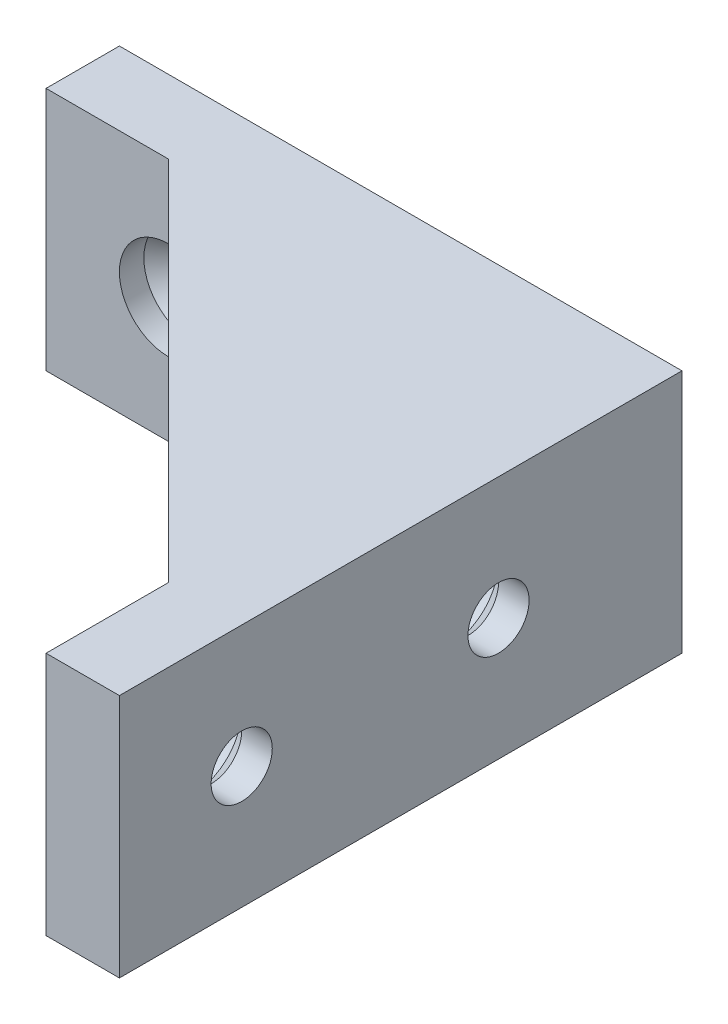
ISO-10303-21;
HEADER;
FILE_DESCRIPTION(('STEP AP214'),'2;1');
FILE_NAME('part.step','',(''),(''),'','','');
FILE_SCHEMA(('AUTOMOTIVE_DESIGN { 1 0 10303 214 1 1 1 1 }'));
ENDSEC;
DATA;
#1=APPLICATION_CONTEXT('core data for automotive mechanical design processes');
#2=APPLICATION_PROTOCOL_DEFINITION('international standard','automotive_design',2000,#1);
#3=PRODUCT_CONTEXT('',#1,'mechanical');
#4=PRODUCT('Part','Part','',(#3));
#5=PRODUCT_RELATED_PRODUCT_CATEGORY('part','',(#4));
#6=PRODUCT_DEFINITION_FORMATION('','',#4);
#7=PRODUCT_DEFINITION_CONTEXT('part definition',#1,'design');
#8=PRODUCT_DEFINITION('design','',#6,#7);
#9=PRODUCT_DEFINITION_SHAPE('','',#8);
#10=(LENGTH_UNIT() NAMED_UNIT(*) SI_UNIT(.MILLI.,.METRE.));
#11=(NAMED_UNIT(*) PLANE_ANGLE_UNIT() SI_UNIT($,.RADIAN.));
#12=(NAMED_UNIT(*) SI_UNIT($,.STERADIAN.) SOLID_ANGLE_UNIT());
#13=UNCERTAINTY_MEASURE_WITH_UNIT(LENGTH_MEASURE(1.E-05),#10,'distance_accuracy_value','');
#14=(GEOMETRIC_REPRESENTATION_CONTEXT(3) GLOBAL_UNCERTAINTY_ASSIGNED_CONTEXT((#13)) GLOBAL_UNIT_ASSIGNED_CONTEXT((#10,
#11,#12)) REPRESENTATION_CONTEXT('',''));
#15=CARTESIAN_POINT('',(0.,0.,0.));
#16=DIRECTION('',(0.,0.,1.));
#17=DIRECTION('',(1.,0.,0.));
#18=AXIS2_PLACEMENT_3D('',#15,#16,#17);
#19=CARTESIAN_POINT('',(31.,10.,40.));
#20=DIRECTION('',(0.,0.,-1.));
#21=DIRECTION('',(-1.,0.,0.));
#22=AXIS2_PLACEMENT_3D('',#19,#20,#21);
#23=CYLINDRICAL_SURFACE('',#22,4.);
#24=CARTESIAN_POINT('',(31.,10.,-2.));
#25=DIRECTION('',(0.,0.,-1.));
#26=DIRECTION('',(-1.,0.,0.));
#27=AXIS2_PLACEMENT_3D('',#24,#25,#26);
#28=CIRCLE('',#27,4.);
#29=CARTESIAN_POINT('',(27.,10.,-2.));
#30=VERTEX_POINT('',#29);
#31=EDGE_CURVE('E473',#30,#30,#28,.T.);
#32=ORIENTED_EDGE('',*,*,#31,.T.);
#33=EDGE_LOOP('',(#32));
#34=FACE_BOUND('',#33,.T.);
#35=CARTESIAN_POINT('',(31.,10.,8.99999999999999));
#36=DIRECTION('',(-0.707106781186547,0.,-0.707106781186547));
#37=DIRECTION('',(0.707106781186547,0.,-0.707106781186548));
#38=AXIS2_PLACEMENT_3D('',#35,#36,#37);
#39=ELLIPSE('',#38,5.65685424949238,4.);
#40=CARTESIAN_POINT('',(31.,6.,8.99999999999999));
#41=VERTEX_POINT('',#40);
#42=CARTESIAN_POINT('',(31.,14.,8.99999999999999));
#43=VERTEX_POINT('',#42);
#44=EDGE_CURVE('E50',#41,#43,#39,.F.);
#45=ORIENTED_EDGE('',*,*,#44,.T.);
#46=CARTESIAN_POINT('',(31.,10.,8.99999999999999));
#47=DIRECTION('',(0.707106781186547,0.,-0.707106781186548));
#48=DIRECTION('',(-0.707106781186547,0.,-0.707106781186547));
#49=AXIS2_PLACEMENT_3D('',#46,#47,#48);
#50=ELLIPSE('',#49,5.65685424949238,4.);
#51=EDGE_CURVE('E117',#43,#41,#50,.F.);
#52=ORIENTED_EDGE('',*,*,#51,.T.);
#53=EDGE_LOOP('',(#45,#52));
#54=FACE_BOUND('',#53,.T.);
#55=ADVANCED_FACE('F35',(#34,#54),#23,.F.);
#56=CARTESIAN_POINT('',(0.,10.,8.99999999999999));
#57=DIRECTION('',(1.,0.,0.));
#58=DIRECTION('',(0.,0.,-1.));
#59=AXIS2_PLACEMENT_3D('',#56,#57,#58);
#60=CYLINDRICAL_SURFACE('',#59,2.5);
#61=CARTESIAN_POINT('',(43.5,10.,8.99999999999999));
#62=DIRECTION('',(1.,0.,0.));
#63=DIRECTION('',(0.,0.,-1.));
#64=AXIS2_PLACEMENT_3D('',#61,#62,#63);
#65=CIRCLE('',#64,2.5);
#66=CARTESIAN_POINT('',(43.5,10.,6.49999999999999));
#67=VERTEX_POINT('',#66);
#68=EDGE_CURVE('E44',#67,#67,#65,.F.);
#69=ORIENTED_EDGE('',*,*,#68,.T.);
#70=EDGE_LOOP('',(#69));
#71=FACE_BOUND('',#70,.T.);
#72=CARTESIAN_POINT('',(46.,10.,8.99999999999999));
#73=DIRECTION('',(1.,0.,0.));
#74=DIRECTION('',(0.,0.,-1.));
#75=AXIS2_PLACEMENT_3D('',#72,#73,#74);
#76=CIRCLE('',#75,2.5);
#77=CARTESIAN_POINT('',(46.,10.,6.49999999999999));
#78=VERTEX_POINT('',#77);
#79=EDGE_CURVE('E394',#78,#78,#76,.T.);
#80=ORIENTED_EDGE('',*,*,#79,.T.);
#81=EDGE_LOOP('',(#80));
#82=FACE_BOUND('',#81,.T.);
#83=ADVANCED_FACE('F141',(#71,#82),#60,.F.);
#84=CARTESIAN_POINT('',(0.,20.,-6.));
#85=DIRECTION('',(1.,0.,0.));
#86=DIRECTION('',(0.,0.,-1.));
#87=AXIS2_PLACEMENT_3D('',#84,#85,#86);
#88=PLANE('',#87);
#89=DIRECTION('',(0.,0.,1.));
#90=VECTOR('',#89,1.);
#91=CARTESIAN_POINT('',(0.,0.,-6.));
#92=LINE('',#91,#90);
#93=CARTESIAN_POINT('',(0.,0.,-6.));
#94=VERTEX_POINT('',#93);
#95=CARTESIAN_POINT('',(0.,0.,0.));
#96=VERTEX_POINT('',#95);
#97=EDGE_CURVE('E380',#94,#96,#92,.T.);
#98=ORIENTED_EDGE('',*,*,#97,.T.);
#99=DIRECTION('',(0.,-1.,0.));
#100=VECTOR('',#99,1.);
#101=CARTESIAN_POINT('',(0.,20.,0.));
#102=LINE('',#101,#100);
#103=CARTESIAN_POINT('',(0.,20.,0.));
#104=VERTEX_POINT('',#103);
#105=EDGE_CURVE('E383',#104,#96,#102,.T.);
#106=ORIENTED_EDGE('',*,*,#105,.F.);
#107=DIRECTION('',(0.,0.,1.));
#108=VECTOR('',#107,1.);
#109=CARTESIAN_POINT('',(0.,20.,-6.));
#110=LINE('',#109,#108);
#111=CARTESIAN_POINT('',(0.,20.,-6.));
#112=VERTEX_POINT('',#111);
#113=EDGE_CURVE('E410',#112,#104,#110,.T.);
#114=ORIENTED_EDGE('',*,*,#113,.F.);
#115=DIRECTION('',(0.,-1.,0.));
#116=VECTOR('',#115,1.);
#117=CARTESIAN_POINT('',(0.,20.,-6.));
#118=LINE('',#117,#116);
#119=EDGE_CURVE('E385',#112,#94,#118,.T.);
#120=ORIENTED_EDGE('',*,*,#119,.T.);
#121=EDGE_LOOP('',(#98,#106,#114,#120));
#122=FACE_BOUND('',#121,.T.);
#123=ADVANCED_FACE('F164',(#122),#88,.F.);
#124=CARTESIAN_POINT('',(0.,20.,0.));
#125=DIRECTION('',(0.,0.,-1.));
#126=DIRECTION('',(-1.,0.,0.));
#127=AXIS2_PLACEMENT_3D('',#124,#125,#126);
#128=PLANE('',#127);
#129=DIRECTION('',(0.,-1.,0.));
#130=VECTOR('',#129,1.);
#131=CARTESIAN_POINT('',(10.,20.,0.));
#132=LINE('',#131,#130);
#133=CARTESIAN_POINT('',(10.,6.,0.));
#134=VERTEX_POINT('',#133);
#135=CARTESIAN_POINT('',(10.,0.,0.));
#136=VERTEX_POINT('',#135);
#137=EDGE_CURVE('E425',#134,#136,#132,.T.);
#138=ORIENTED_EDGE('',*,*,#137,.F.);
#139=CARTESIAN_POINT('',(10.,10.,0.));
#140=DIRECTION('',(0.,0.,-1.));
#141=DIRECTION('',(-1.,0.,0.));
#142=AXIS2_PLACEMENT_3D('',#139,#140,#141);
#143=CIRCLE('',#142,4.);
#144=CARTESIAN_POINT('',(10.,14.,0.));
#145=VERTEX_POINT('',#144);
#146=EDGE_CURVE('E437',#134,#145,#143,.T.);
#147=ORIENTED_EDGE('',*,*,#146,.T.);
#148=CARTESIAN_POINT('',(10.,20.,0.));
#149=VERTEX_POINT('',#148);
#150=EDGE_CURVE('E426',#149,#145,#132,.T.);
#151=ORIENTED_EDGE('',*,*,#150,.F.);
#152=DIRECTION('',(1.,0.,0.));
#153=VECTOR('',#152,1.);
#154=CARTESIAN_POINT('',(0.,20.,0.));
#155=LINE('',#154,#153);
#156=EDGE_CURVE('E446',#104,#149,#155,.T.);
#157=ORIENTED_EDGE('',*,*,#156,.F.);
#158=ORIENTED_EDGE('',*,*,#105,.T.);
#159=DIRECTION('',(1.,0.,0.));
#160=VECTOR('',#159,1.);
#161=CARTESIAN_POINT('',(0.,0.,0.));
#162=LINE('',#161,#160);
#163=EDGE_CURVE('E387',#96,#136,#162,.T.);
#164=ORIENTED_EDGE('',*,*,#163,.T.);
#165=EDGE_LOOP('',(#138,#147,#151,#157,#158,#164));
#166=FACE_BOUND('',#165,.T.);
#167=ADVANCED_FACE('F336',(#166),#128,.F.);
#168=CARTESIAN_POINT('',(40.,20.,30.));
#169=DIRECTION('',(0.707106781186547,0.,-0.707106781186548));
#170=DIRECTION('',(-0.707106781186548,0.,-0.707106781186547));
#171=AXIS2_PLACEMENT_3D('',#168,#169,#170);
#172=PLANE('',#171);
#173=CARTESIAN_POINT('',(19.,10.,8.99999999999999));
#174=DIRECTION('',(0.707106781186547,0.,-0.707106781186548));
#175=DIRECTION('',(0.707106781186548,0.,0.707106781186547));
#176=AXIS2_PLACEMENT_3D('',#173,#174,#175);
#177=ELLIPSE('',#176,5.65685424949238,4.);
#178=CARTESIAN_POINT('',(23.,10.,13.));
#179=VERTEX_POINT('',#178);
#180=EDGE_CURVE('E477',#179,#179,#177,.T.);
#181=ORIENTED_EDGE('',*,*,#180,.T.);
#182=EDGE_LOOP('',(#181));
#183=FACE_BOUND('',#182,.T.);
#184=CARTESIAN_POINT('',(31.,10.,21.));
#185=DIRECTION('',(0.707106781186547,0.,-0.707106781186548));
#186=DIRECTION('',(-0.707106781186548,0.,-0.707106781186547));
#187=AXIS2_PLACEMENT_3D('',#184,#185,#186);
#188=ELLIPSE('',#187,5.65685424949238,4.);
#189=CARTESIAN_POINT('',(27.,10.,17.));
#190=VERTEX_POINT('',#189);
#191=EDGE_CURVE('E469',#190,#190,#188,.T.);
#192=ORIENTED_EDGE('',*,*,#191,.T.);
#193=EDGE_LOOP('',(#192));
#194=FACE_BOUND('',#193,.T.);
#195=DIRECTION('',(0.,-1.,0.));
#196=VECTOR('',#195,1.);
#197=CARTESIAN_POINT('',(40.,20.,30.));
#198=LINE('',#197,#196);
#199=CARTESIAN_POINT('',(40.,6.,30.));
#200=VERTEX_POINT('',#199);
#201=CARTESIAN_POINT('',(40.,0.,30.));
#202=VERTEX_POINT('',#201);
#203=EDGE_CURVE('E421',#200,#202,#198,.T.);
#204=ORIENTED_EDGE('',*,*,#203,.F.);
#205=CARTESIAN_POINT('',(40.,10.,30.));
#206=DIRECTION('',(0.707106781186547,0.,-0.707106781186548));
#207=DIRECTION('',(0.707106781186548,0.,0.707106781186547));
#208=AXIS2_PLACEMENT_3D('',#205,#206,#207);
#209=ELLIPSE('',#208,5.65685424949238,4.);
#210=CARTESIAN_POINT('',(40.,14.,30.));
#211=VERTEX_POINT('',#210);
#212=EDGE_CURVE('E57',#200,#211,#209,.T.);
#213=ORIENTED_EDGE('',*,*,#212,.T.);
#214=CARTESIAN_POINT('',(40.,20.,30.));
#215=VERTEX_POINT('',#214);
#216=EDGE_CURVE('E422',#215,#211,#198,.T.);
#217=ORIENTED_EDGE('',*,*,#216,.F.);
#218=DIRECTION('',(0.707106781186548,0.,0.707106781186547));
#219=VECTOR('',#218,1.);
#220=CARTESIAN_POINT('',(40.,20.,30.));
#221=LINE('',#220,#219);
#222=EDGE_CURVE('E445',#149,#215,#221,.T.);
#223=ORIENTED_EDGE('',*,*,#222,.F.);
#224=ORIENTED_EDGE('',*,*,#150,.T.);
#225=CARTESIAN_POINT('',(10.,10.,0.));
#226=DIRECTION('',(0.707106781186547,0.,-0.707106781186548));
#227=DIRECTION('',(-0.707106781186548,0.,-0.707106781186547));
#228=AXIS2_PLACEMENT_3D('',#225,#226,#227);
#229=ELLIPSE('',#228,5.65685424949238,4.);
#230=EDGE_CURVE('E124',#145,#134,#229,.T.);
#231=ORIENTED_EDGE('',*,*,#230,.T.);
#232=ORIENTED_EDGE('',*,*,#137,.T.);
#233=DIRECTION('',(0.707106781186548,0.,0.707106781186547));
#234=VECTOR('',#233,1.);
#235=CARTESIAN_POINT('',(40.,0.,30.));
#236=LINE('',#235,#234);
#237=EDGE_CURVE('E391',#136,#202,#236,.T.);
#238=ORIENTED_EDGE('',*,*,#237,.T.);
#239=EDGE_LOOP('',(#204,#213,#217,#223,#224,#231,#232,#238));
#240=FACE_BOUND('',#239,.T.);
#241=ADVANCED_FACE('F328',(#183,#194,#240),#172,.F.);
#242=CARTESIAN_POINT('',(40.,20.,30.));
#243=DIRECTION('',(1.,0.,0.));
#244=DIRECTION('',(0.,0.,-1.));
#245=AXIS2_PLACEMENT_3D('',#242,#243,#244);
#246=PLANE('',#245);
#247=ORIENTED_EDGE('',*,*,#216,.T.);
#248=CARTESIAN_POINT('',(40.,10.,30.));
#249=DIRECTION('',(1.,0.,0.));
#250=DIRECTION('',(0.,0.,-1.));
#251=AXIS2_PLACEMENT_3D('',#248,#249,#250);
#252=CIRCLE('',#251,4.);
#253=EDGE_CURVE('E126',#211,#200,#252,.T.);
#254=ORIENTED_EDGE('',*,*,#253,.T.);
#255=ORIENTED_EDGE('',*,*,#203,.T.);
#256=DIRECTION('',(0.,0.,1.));
#257=VECTOR('',#256,1.);
#258=CARTESIAN_POINT('',(40.,0.,30.));
#259=LINE('',#258,#257);
#260=CARTESIAN_POINT('',(40.,0.,40.));
#261=VERTEX_POINT('',#260);
#262=EDGE_CURVE('E402',#202,#261,#259,.T.);
#263=ORIENTED_EDGE('',*,*,#262,.T.);
#264=DIRECTION('',(0.,-1.,0.));
#265=VECTOR('',#264,1.);
#266=CARTESIAN_POINT('',(40.,20.,40.));
#267=LINE('',#266,#265);
#268=CARTESIAN_POINT('',(40.,20.,40.));
#269=VERTEX_POINT('',#268);
#270=EDGE_CURVE('E418',#269,#261,#267,.T.);
#271=ORIENTED_EDGE('',*,*,#270,.F.);
#272=DIRECTION('',(0.,0.,1.));
#273=VECTOR('',#272,1.);
#274=CARTESIAN_POINT('',(40.,20.,30.));
#275=LINE('',#274,#273);
#276=EDGE_CURVE('E444',#215,#269,#275,.T.);
#277=ORIENTED_EDGE('',*,*,#276,.F.);
#278=EDGE_LOOP('',(#247,#254,#255,#263,#271,#277));
#279=FACE_BOUND('',#278,.T.);
#280=ADVANCED_FACE('F319',(#279),#246,.F.);
#281=CARTESIAN_POINT('',(40.,20.,40.));
#282=DIRECTION('',(0.,0.,-1.));
#283=DIRECTION('',(-1.,0.,0.));
#284=AXIS2_PLACEMENT_3D('',#281,#282,#283);
#285=PLANE('',#284);
#286=DIRECTION('',(1.,0.,0.));
#287=VECTOR('',#286,1.);
#288=CARTESIAN_POINT('',(40.,0.,40.));
#289=LINE('',#288,#287);
#290=CARTESIAN_POINT('',(46.,0.,40.));
#291=VERTEX_POINT('',#290);
#292=EDGE_CURVE('E404',#261,#291,#289,.T.);
#293=ORIENTED_EDGE('',*,*,#292,.T.);
#294=DIRECTION('',(0.,-1.,0.));
#295=VECTOR('',#294,1.);
#296=CARTESIAN_POINT('',(46.,20.,40.));
#297=LINE('',#296,#295);
#298=CARTESIAN_POINT('',(46.,20.,40.));
#299=VERTEX_POINT('',#298);
#300=EDGE_CURVE('E415',#299,#291,#297,.T.);
#301=ORIENTED_EDGE('',*,*,#300,.F.);
#302=DIRECTION('',(1.,0.,0.));
#303=VECTOR('',#302,1.);
#304=CARTESIAN_POINT('',(40.,20.,40.));
#305=LINE('',#304,#303);
#306=EDGE_CURVE('E448',#269,#299,#305,.T.);
#307=ORIENTED_EDGE('',*,*,#306,.F.);
#308=ORIENTED_EDGE('',*,*,#270,.T.);
#309=EDGE_LOOP('',(#293,#301,#307,#308));
#310=FACE_BOUND('',#309,.T.);
#311=ADVANCED_FACE('F311',(#310),#285,.F.);
#312=CARTESIAN_POINT('',(46.,20.,-6.));
#313=DIRECTION('',(-1.,0.,0.));
#314=DIRECTION('',(0.,0.,1.));
#315=AXIS2_PLACEMENT_3D('',#312,#313,#314);
#316=PLANE('',#315);
#317=CARTESIAN_POINT('',(46.,10.,30.));
#318=DIRECTION('',(1.,0.,0.));
#319=DIRECTION('',(0.,0.,-1.));
#320=AXIS2_PLACEMENT_3D('',#317,#318,#319);
#321=CIRCLE('',#320,2.5);
#322=CARTESIAN_POINT('',(46.,10.,27.5));
#323=VERTEX_POINT('',#322);
#324=EDGE_CURVE('E388',#323,#323,#321,.T.);
#325=ORIENTED_EDGE('',*,*,#324,.F.);
#326=EDGE_LOOP('',(#325));
#327=FACE_BOUND('',#326,.T.);
#328=ORIENTED_EDGE('',*,*,#79,.F.);
#329=EDGE_LOOP('',(#328));
#330=FACE_BOUND('',#329,.T.);
#331=DIRECTION('',(0.,0.,-1.));
#332=VECTOR('',#331,1.);
#333=CARTESIAN_POINT('',(46.,0.,-6.));
#334=LINE('',#333,#332);
#335=CARTESIAN_POINT('',(46.,0.,-6.));
#336=VERTEX_POINT('',#335);
#337=EDGE_CURVE('E406',#291,#336,#334,.T.);
#338=ORIENTED_EDGE('',*,*,#337,.T.);
#339=DIRECTION('',(0.,-1.,0.));
#340=VECTOR('',#339,1.);
#341=CARTESIAN_POINT('',(46.,20.,-6.));
#342=LINE('',#341,#340);
#343=CARTESIAN_POINT('',(46.,20.,-6.));
#344=VERTEX_POINT('',#343);
#345=EDGE_CURVE('E412',#344,#336,#342,.T.);
#346=ORIENTED_EDGE('',*,*,#345,.F.);
#347=DIRECTION('',(0.,0.,-1.));
#348=VECTOR('',#347,1.);
#349=CARTESIAN_POINT('',(46.,20.,-6.));
#350=LINE('',#349,#348);
#351=EDGE_CURVE('E453',#299,#344,#350,.T.);
#352=ORIENTED_EDGE('',*,*,#351,.F.);
#353=ORIENTED_EDGE('',*,*,#300,.T.);
#354=EDGE_LOOP('',(#338,#346,#352,#353));
#355=FACE_BOUND('',#354,.T.);
#356=ADVANCED_FACE('F303',(#327,#330,#355),#316,.F.);
#357=CARTESIAN_POINT('',(0.,20.,-6.));
#358=DIRECTION('',(0.,0.,1.));
#359=DIRECTION('',(1.,0.,0.));
#360=AXIS2_PLACEMENT_3D('',#357,#358,#359);
#361=PLANE('',#360);
#362=CARTESIAN_POINT('',(10.,10.,-6.));
#363=DIRECTION('',(0.,0.,-1.));
#364=DIRECTION('',(-1.,0.,0.));
#365=AXIS2_PLACEMENT_3D('',#362,#363,#364);
#366=CIRCLE('',#365,2.5);
#367=CARTESIAN_POINT('',(7.5,10.,-6.));
#368=VERTEX_POINT('',#367);
#369=EDGE_CURVE('E461',#368,#368,#366,.T.);
#370=ORIENTED_EDGE('',*,*,#369,.F.);
#371=EDGE_LOOP('',(#370));
#372=FACE_BOUND('',#371,.T.);
#373=CARTESIAN_POINT('',(31.,10.,-6.));
#374=DIRECTION('',(0.,0.,-1.));
#375=DIRECTION('',(-1.,0.,0.));
#376=AXIS2_PLACEMENT_3D('',#373,#374,#375);
#377=CIRCLE('',#376,2.5);
#378=CARTESIAN_POINT('',(28.5,10.,-6.));
#379=VERTEX_POINT('',#378);
#380=EDGE_CURVE('E463',#379,#379,#377,.T.);
#381=ORIENTED_EDGE('',*,*,#380,.F.);
#382=EDGE_LOOP('',(#381));
#383=FACE_BOUND('',#382,.T.);
#384=DIRECTION('',(-1.,0.,0.));
#385=VECTOR('',#384,1.);
#386=CARTESIAN_POINT('',(0.,0.,-6.));
#387=LINE('',#386,#385);
#388=EDGE_CURVE('E408',#336,#94,#387,.T.);
#389=ORIENTED_EDGE('',*,*,#388,.T.);
#390=ORIENTED_EDGE('',*,*,#119,.F.);
#391=DIRECTION('',(-1.,0.,0.));
#392=VECTOR('',#391,1.);
#393=CARTESIAN_POINT('',(0.,20.,-6.));
#394=LINE('',#393,#392);
#395=EDGE_CURVE('E397',#344,#112,#394,.T.);
#396=ORIENTED_EDGE('',*,*,#395,.F.);
#397=ORIENTED_EDGE('',*,*,#345,.T.);
#398=EDGE_LOOP('',(#389,#390,#396,#397));
#399=FACE_BOUND('',#398,.T.);
#400=ADVANCED_FACE('F293',(#372,#383,#399),#361,.F.);
#401=CARTESIAN_POINT('',(0.,20.,0.));
#402=DIRECTION('',(0.,1.,0.));
#403=DIRECTION('',(0.,0.,1.));
#404=AXIS2_PLACEMENT_3D('',#401,#402,#403);
#405=PLANE('',#404);
#406=ORIENTED_EDGE('',*,*,#113,.T.);
#407=ORIENTED_EDGE('',*,*,#156,.T.);
#408=ORIENTED_EDGE('',*,*,#222,.T.);
#409=ORIENTED_EDGE('',*,*,#276,.T.);
#410=ORIENTED_EDGE('',*,*,#306,.T.);
#411=ORIENTED_EDGE('',*,*,#351,.T.);
#412=ORIENTED_EDGE('',*,*,#395,.T.);
#413=EDGE_LOOP('',(#406,#407,#408,#409,#410,#411,#412));
#414=FACE_BOUND('',#413,.T.);
#415=ADVANCED_FACE('F283',(#414),#405,.T.);
#416=CARTESIAN_POINT('',(0.,0.,0.));
#417=DIRECTION('',(0.,1.,0.));
#418=DIRECTION('',(0.,0.,1.));
#419=AXIS2_PLACEMENT_3D('',#416,#417,#418);
#420=PLANE('',#419);
#421=ORIENTED_EDGE('',*,*,#97,.F.);
#422=ORIENTED_EDGE('',*,*,#388,.F.);
#423=ORIENTED_EDGE('',*,*,#337,.F.);
#424=ORIENTED_EDGE('',*,*,#292,.F.);
#425=ORIENTED_EDGE('',*,*,#262,.F.);
#426=ORIENTED_EDGE('',*,*,#237,.F.);
#427=ORIENTED_EDGE('',*,*,#163,.F.);
#428=EDGE_LOOP('',(#421,#422,#423,#424,#425,#426,#427));
#429=FACE_BOUND('',#428,.T.);
#430=ADVANCED_FACE('F274',(#429),#420,.F.);
#431=CARTESIAN_POINT('',(0.,10.,30.));
#432=DIRECTION('',(1.,0.,0.));
#433=DIRECTION('',(0.,0.,-1.));
#434=AXIS2_PLACEMENT_3D('',#431,#432,#433);
#435=CYLINDRICAL_SURFACE('',#434,2.5);
#436=CARTESIAN_POINT('',(43.5,10.,30.));
#437=DIRECTION('',(1.,0.,0.));
#438=DIRECTION('',(0.,0.,-1.));
#439=AXIS2_PLACEMENT_3D('',#436,#437,#438);
#440=CIRCLE('',#439,2.5);
#441=CARTESIAN_POINT('',(43.5,10.,27.5));
#442=VERTEX_POINT('',#441);
#443=EDGE_CURVE('E11',#442,#442,#440,.F.);
#444=ORIENTED_EDGE('',*,*,#443,.T.);
#445=EDGE_LOOP('',(#444));
#446=FACE_BOUND('',#445,.T.);
#447=ORIENTED_EDGE('',*,*,#324,.T.);
#448=EDGE_LOOP('',(#447));
#449=FACE_BOUND('',#448,.T.);
#450=ADVANCED_FACE('F261',(#446,#449),#435,.F.);
#451=CARTESIAN_POINT('',(31.,10.,40.));
#452=DIRECTION('',(0.,0.,-1.));
#453=DIRECTION('',(-1.,0.,0.));
#454=AXIS2_PLACEMENT_3D('',#451,#452,#453);
#455=CYLINDRICAL_SURFACE('',#454,2.5);
#456=CARTESIAN_POINT('',(31.,10.,-3.5));
#457=DIRECTION('',(0.,0.,-1.));
#458=DIRECTION('',(-1.,0.,0.));
#459=AXIS2_PLACEMENT_3D('',#456,#457,#458);
#460=CIRCLE('',#459,2.5);
#461=CARTESIAN_POINT('',(28.5,10.,-3.5));
#462=VERTEX_POINT('',#461);
#463=EDGE_CURVE('E136',#462,#462,#460,.F.);
#464=ORIENTED_EDGE('',*,*,#463,.T.);
#465=EDGE_LOOP('',(#464));
#466=FACE_BOUND('',#465,.T.);
#467=ORIENTED_EDGE('',*,*,#380,.T.);
#468=EDGE_LOOP('',(#467));
#469=FACE_BOUND('',#468,.T.);
#470=ADVANCED_FACE('F182',(#466,#469),#455,.F.);
#471=CARTESIAN_POINT('',(10.,10.,40.));
#472=DIRECTION('',(0.,0.,-1.));
#473=DIRECTION('',(-1.,0.,0.));
#474=AXIS2_PLACEMENT_3D('',#471,#472,#473);
#475=CYLINDRICAL_SURFACE('',#474,2.5);
#476=CARTESIAN_POINT('',(10.,10.,-3.5));
#477=DIRECTION('',(0.,0.,-1.));
#478=DIRECTION('',(-1.,0.,0.));
#479=AXIS2_PLACEMENT_3D('',#476,#477,#478);
#480=CIRCLE('',#479,2.5);
#481=CARTESIAN_POINT('',(7.5,10.,-3.5));
#482=VERTEX_POINT('',#481);
#483=EDGE_CURVE('E133',#482,#482,#480,.F.);
#484=ORIENTED_EDGE('',*,*,#483,.T.);
#485=EDGE_LOOP('',(#484));
#486=FACE_BOUND('',#485,.T.);
#487=ORIENTED_EDGE('',*,*,#369,.T.);
#488=EDGE_LOOP('',(#487));
#489=FACE_BOUND('',#488,.T.);
#490=ADVANCED_FACE('F177',(#486,#489),#475,.F.);
#491=CARTESIAN_POINT('',(10.,10.,40.));
#492=DIRECTION('',(0.,0.,-1.));
#493=DIRECTION('',(-1.,0.,0.));
#494=AXIS2_PLACEMENT_3D('',#491,#492,#493);
#495=CYLINDRICAL_SURFACE('',#494,4.);
#496=CARTESIAN_POINT('',(10.,10.,-2.));
#497=DIRECTION('',(0.,0.,-1.));
#498=DIRECTION('',(-1.,0.,0.));
#499=AXIS2_PLACEMENT_3D('',#496,#497,#498);
#500=CIRCLE('',#499,4.);
#501=CARTESIAN_POINT('',(6.,10.,-2.));
#502=VERTEX_POINT('',#501);
#503=EDGE_CURVE('E472',#502,#502,#500,.T.);
#504=ORIENTED_EDGE('',*,*,#503,.T.);
#505=EDGE_LOOP('',(#504));
#506=FACE_BOUND('',#505,.T.);
#507=ORIENTED_EDGE('',*,*,#230,.F.);
#508=ORIENTED_EDGE('',*,*,#146,.F.);
#509=EDGE_LOOP('',(#507,#508));
#510=FACE_BOUND('',#509,.T.);
#511=ADVANCED_FACE('F170',(#506,#510),#495,.F.);
#512=CARTESIAN_POINT('',(31.,10.,8.99999999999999));
#513=DIRECTION('',(-0.707106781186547,0.,-0.707106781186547));
#514=DIRECTION('',(0.707106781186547,0.,-0.707106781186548));
#515=AXIS2_PLACEMENT_3D('',#512,#513,#514);
#516=ELLIPSE('',#515,5.65685424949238,4.);
#517=EDGE_CURVE('E114',#41,#43,#516,.T.);
#518=ORIENTED_EDGE('',*,*,#517,.T.);
#519=CARTESIAN_POINT('',(31.,10.,8.99999999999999));
#520=DIRECTION('',(0.707106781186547,0.,-0.707106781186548));
#521=DIRECTION('',(-0.707106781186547,0.,-0.707106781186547));
#522=AXIS2_PLACEMENT_3D('',#519,#520,#521);
#523=ELLIPSE('',#522,5.65685424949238,4.);
#524=EDGE_CURVE('E120',#43,#41,#523,.T.);
#525=ORIENTED_EDGE('',*,*,#524,.T.);
#526=EDGE_LOOP('',(#518,#525));
#527=FACE_BOUND('',#526,.T.);
#528=ORIENTED_EDGE('',*,*,#191,.F.);
#529=EDGE_LOOP('',(#528));
#530=FACE_BOUND('',#529,.T.);
#531=ADVANCED_FACE('F128',(#527,#530),#23,.F.);
#532=CARTESIAN_POINT('',(0.,10.,9.));
#533=DIRECTION('',(1.,0.,0.));
#534=DIRECTION('',(0.,0.,-1.));
#535=AXIS2_PLACEMENT_3D('',#532,#533,#534);
#536=CYLINDRICAL_SURFACE('',#535,4.);
#537=CARTESIAN_POINT('',(42.,10.,8.99999999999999));
#538=DIRECTION('',(1.,0.,0.));
#539=DIRECTION('',(0.,0.,-1.));
#540=AXIS2_PLACEMENT_3D('',#537,#538,#539);
#541=CIRCLE('',#540,4.);
#542=CARTESIAN_POINT('',(42.,10.,4.99999999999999));
#543=VERTEX_POINT('',#542);
#544=EDGE_CURVE('E480',#543,#543,#541,.T.);
#545=ORIENTED_EDGE('',*,*,#544,.T.);
#546=EDGE_LOOP('',(#545));
#547=FACE_BOUND('',#546,.T.);
#548=ORIENTED_EDGE('',*,*,#44,.F.);
#549=ORIENTED_EDGE('',*,*,#524,.F.);
#550=EDGE_LOOP('',(#548,#549));
#551=FACE_BOUND('',#550,.T.);
#552=ADVANCED_FACE('F123',(#547,#551),#536,.F.);
#553=ORIENTED_EDGE('',*,*,#517,.F.);
#554=ORIENTED_EDGE('',*,*,#51,.F.);
#555=EDGE_LOOP('',(#553,#554));
#556=FACE_BOUND('',#555,.T.);
#557=ORIENTED_EDGE('',*,*,#180,.F.);
#558=EDGE_LOOP('',(#557));
#559=FACE_BOUND('',#558,.T.);
#560=ADVANCED_FACE('F115',(#556,#559),#536,.F.);
#561=CARTESIAN_POINT('',(0.,10.,30.));
#562=DIRECTION('',(1.,0.,0.));
#563=DIRECTION('',(0.,0.,-1.));
#564=AXIS2_PLACEMENT_3D('',#561,#562,#563);
#565=CYLINDRICAL_SURFACE('',#564,4.);
#566=CARTESIAN_POINT('',(42.,10.,30.));
#567=DIRECTION('',(1.,0.,0.));
#568=DIRECTION('',(0.,0.,-1.));
#569=AXIS2_PLACEMENT_3D('',#566,#567,#568);
#570=CIRCLE('',#569,4.);
#571=CARTESIAN_POINT('',(42.,10.,26.));
#572=VERTEX_POINT('',#571);
#573=EDGE_CURVE('E481',#572,#572,#570,.T.);
#574=ORIENTED_EDGE('',*,*,#573,.T.);
#575=EDGE_LOOP('',(#574));
#576=FACE_BOUND('',#575,.T.);
#577=ORIENTED_EDGE('',*,*,#253,.F.);
#578=ORIENTED_EDGE('',*,*,#212,.F.);
#579=EDGE_LOOP('',(#577,#578));
#580=FACE_BOUND('',#579,.T.);
#581=ADVANCED_FACE('F187',(#576,#580),#565,.F.);
#582=CARTESIAN_POINT('',(10.,10.,-3.5));
#583=DIRECTION('',(0.,0.,1.));
#584=DIRECTION('',(1.,0.,0.));
#585=AXIS2_PLACEMENT_3D('',#582,#583,#584);
#586=CONICAL_SURFACE('',#585,2.5,0.785398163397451);
#587=ORIENTED_EDGE('',*,*,#503,.F.);
#588=EDGE_LOOP('',(#587));
#589=FACE_BOUND('',#588,.T.);
#590=ORIENTED_EDGE('',*,*,#483,.F.);
#591=EDGE_LOOP('',(#590));
#592=FACE_BOUND('',#591,.T.);
#593=ADVANCED_FACE('F153',(#589,#592),#586,.F.);
#594=CARTESIAN_POINT('',(31.,10.,-3.5));
#595=DIRECTION('',(0.,0.,1.));
#596=DIRECTION('',(1.,0.,0.));
#597=AXIS2_PLACEMENT_3D('',#594,#595,#596);
#598=CONICAL_SURFACE('',#597,2.5,0.785398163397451);
#599=ORIENTED_EDGE('',*,*,#31,.F.);
#600=EDGE_LOOP('',(#599));
#601=FACE_BOUND('',#600,.T.);
#602=ORIENTED_EDGE('',*,*,#463,.F.);
#603=EDGE_LOOP('',(#602));
#604=FACE_BOUND('',#603,.T.);
#605=ADVANCED_FACE('F146',(#601,#604),#598,.F.);
#606=CARTESIAN_POINT('',(43.5,10.,8.99999999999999));
#607=DIRECTION('',(-1.,0.,0.));
#608=DIRECTION('',(0.,0.,1.));
#609=AXIS2_PLACEMENT_3D('',#606,#607,#608);
#610=CONICAL_SURFACE('',#609,2.5,0.785398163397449);
#611=ORIENTED_EDGE('',*,*,#544,.F.);
#612=EDGE_LOOP('',(#611));
#613=FACE_BOUND('',#612,.T.);
#614=ORIENTED_EDGE('',*,*,#68,.F.);
#615=EDGE_LOOP('',(#614));
#616=FACE_BOUND('',#615,.T.);
#617=ADVANCED_FACE('F144',(#613,#616),#610,.F.);
#618=CARTESIAN_POINT('',(43.5,10.,30.));
#619=DIRECTION('',(-1.,0.,0.));
#620=DIRECTION('',(0.,0.,1.));
#621=AXIS2_PLACEMENT_3D('',#618,#619,#620);
#622=CONICAL_SURFACE('',#621,2.5,0.785398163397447);
#623=ORIENTED_EDGE('',*,*,#573,.F.);
#624=EDGE_LOOP('',(#623));
#625=FACE_BOUND('',#624,.T.);
#626=ORIENTED_EDGE('',*,*,#443,.F.);
#627=EDGE_LOOP('',(#626));
#628=FACE_BOUND('',#627,.T.);
#629=ADVANCED_FACE('F38',(#625,#628),#622,.F.);
#630=CLOSED_SHELL('',(#55,#83,#123,#167,#241,#280,#311,#356,#400,#415,#430,#450,#470,#490,#511,
#531,#552,#560,#581,#593,#605,#617,#629));
#631=MANIFOLD_SOLID_BREP('B2',#630);
#632=ADVANCED_BREP_SHAPE_REPRESENTATION('',(#18,#631),#14);
#633=SHAPE_DEFINITION_REPRESENTATION(#9,#632);
ENDSEC;
END-ISO-10303-21;
